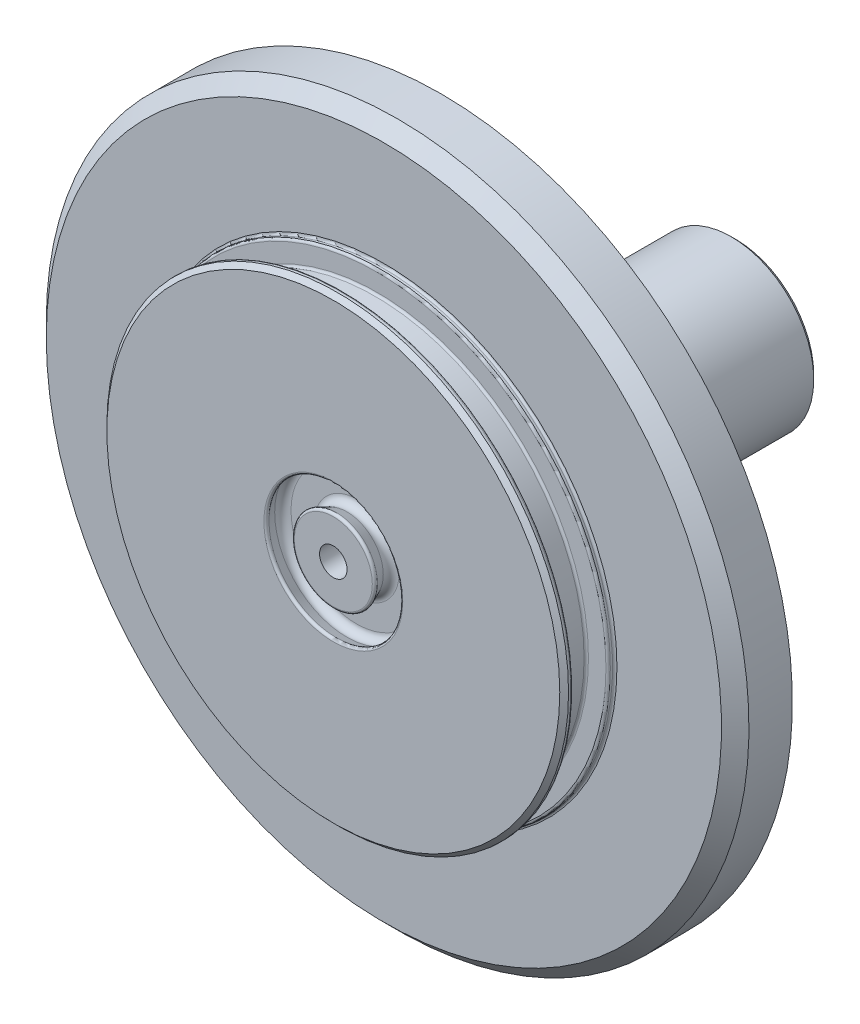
ISO-10303-21;
HEADER;
FILE_DESCRIPTION(('STEP AP214'),'2;1');
FILE_NAME('part.step','',(''),(''),'','','');
FILE_SCHEMA(('AUTOMOTIVE_DESIGN { 1 0 10303 214 1 1 1 1 }'));
ENDSEC;
DATA;
#1=APPLICATION_CONTEXT('core data for automotive mechanical design processes');
#2=APPLICATION_PROTOCOL_DEFINITION('international standard','automotive_design',2000,#1);
#3=PRODUCT_CONTEXT('',#1,'mechanical');
#4=PRODUCT('Part','Part','',(#3));
#5=PRODUCT_RELATED_PRODUCT_CATEGORY('part','',(#4));
#6=PRODUCT_DEFINITION_FORMATION('','',#4);
#7=PRODUCT_DEFINITION_CONTEXT('part definition',#1,'design');
#8=PRODUCT_DEFINITION('design','',#6,#7);
#9=PRODUCT_DEFINITION_SHAPE('','',#8);
#10=(LENGTH_UNIT() NAMED_UNIT(*) SI_UNIT(.MILLI.,.METRE.));
#11=(NAMED_UNIT(*) PLANE_ANGLE_UNIT() SI_UNIT($,.RADIAN.));
#12=(NAMED_UNIT(*) SI_UNIT($,.STERADIAN.) SOLID_ANGLE_UNIT());
#13=UNCERTAINTY_MEASURE_WITH_UNIT(LENGTH_MEASURE(1.E-05),#10,'distance_accuracy_value','');
#14=(GEOMETRIC_REPRESENTATION_CONTEXT(3) GLOBAL_UNCERTAINTY_ASSIGNED_CONTEXT((#13)) GLOBAL_UNIT_ASSIGNED_CONTEXT((#10,
#11,#12)) REPRESENTATION_CONTEXT('',''));
#15=CARTESIAN_POINT('',(0.,0.,0.));
#16=DIRECTION('',(0.,0.,1.));
#17=DIRECTION('',(1.,0.,0.));
#18=AXIS2_PLACEMENT_3D('',#15,#16,#17);
#19=CARTESIAN_POINT('',(0.,0.,1.4605));
#20=DIRECTION('',(0.,0.,-1.));
#21=DIRECTION('',(-1.,0.,0.));
#22=AXIS2_PLACEMENT_3D('',#19,#20,#21);
#23=CYLINDRICAL_SURFACE('',#22,13.335);
#24=CARTESIAN_POINT('',(0.,0.,1.0795));
#25=DIRECTION('',(0.,0.,-1.));
#26=DIRECTION('',(-1.,0.,0.));
#27=AXIS2_PLACEMENT_3D('',#24,#25,#26);
#28=CIRCLE('',#27,13.335);
#29=CARTESIAN_POINT('',(-13.335,0.,1.0795));
#30=VERTEX_POINT('',#29);
#31=EDGE_CURVE('E10',#30,#30,#28,.F.);
#32=ORIENTED_EDGE('',*,*,#31,.T.);
#33=EDGE_LOOP('',(#32));
#34=FACE_BOUND('',#33,.T.);
#35=CARTESIAN_POINT('',(0.,0.,1.20649999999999));
#36=DIRECTION('',(0.,0.,1.));
#37=DIRECTION('',(1.,0.,0.));
#38=AXIS2_PLACEMENT_3D('',#35,#36,#37);
#39=CIRCLE('',#38,13.335);
#40=CARTESIAN_POINT('',(13.335,0.,1.20649999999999));
#41=VERTEX_POINT('',#40);
#42=EDGE_CURVE('E91',#41,#41,#39,.F.);
#43=ORIENTED_EDGE('',*,*,#42,.T.);
#44=EDGE_LOOP('',(#43));
#45=FACE_BOUND('',#44,.T.);
#46=ADVANCED_FACE('F40',(#34,#45),#23,.T.);
#47=CARTESIAN_POINT('',(0.,0.,-1.3335));
#48=DIRECTION('',(0.,0.,-1.));
#49=DIRECTION('',(-1.,0.,0.));
#50=AXIS2_PLACEMENT_3D('',#47,#48,#49);
#51=CIRCLE('',#50,13.335);
#52=CARTESIAN_POINT('',(-13.335,0.,-1.3335));
#53=VERTEX_POINT('',#52);
#54=EDGE_CURVE('E79',#53,#53,#51,.F.);
#55=ORIENTED_EDGE('',*,*,#54,.T.);
#56=EDGE_LOOP('',(#55));
#57=FACE_BOUND('',#56,.T.);
#58=CARTESIAN_POINT('',(0.,0.,-1.2065));
#59=DIRECTION('',(0.,0.,1.));
#60=DIRECTION('',(1.,0.,0.));
#61=AXIS2_PLACEMENT_3D('',#58,#59,#60);
#62=CIRCLE('',#61,13.335);
#63=CARTESIAN_POINT('',(13.335,0.,-1.2065));
#64=VERTEX_POINT('',#63);
#65=EDGE_CURVE('E83',#64,#64,#62,.F.);
#66=ORIENTED_EDGE('',*,*,#65,.T.);
#67=EDGE_LOOP('',(#66));
#68=FACE_BOUND('',#67,.T.);
#69=ADVANCED_FACE('F228',(#57,#68),#23,.T.);
#70=CARTESIAN_POINT('',(0.,0.,-21.7805));
#71=DIRECTION('',(0.,0.,1.));
#72=DIRECTION('',(1.,0.,0.));
#73=AXIS2_PLACEMENT_3D('',#70,#71,#72);
#74=CYLINDRICAL_SURFACE('',#73,4.7625);
#75=CARTESIAN_POINT('',(0.,0.,-2.7305));
#76=DIRECTION('',(0.,0.,-1.));
#77=DIRECTION('',(-1.,0.,0.));
#78=AXIS2_PLACEMENT_3D('',#75,#76,#77);
#79=CIRCLE('',#78,4.7625);
#80=CARTESIAN_POINT('',(4.7625,0.,-2.7305));
#81=VERTEX_POINT('',#80);
#82=EDGE_CURVE('E158',#81,#81,#79,.T.);
#83=CARTESIAN_POINT('',(0.,0.,-9.5885));
#84=DIRECTION('',(0.,0.,-1.));
#85=DIRECTION('',(-1.,0.,0.));
#86=AXIS2_PLACEMENT_3D('',#83,#84,#85);
#87=CIRCLE('',#86,4.7625);
#88=CARTESIAN_POINT('',(4.7625,0.,-9.5885));
#89=VERTEX_POINT('',#88);
#90=EDGE_CURVE('E130',#89,#89,#87,.T.);
#91=CARTESIAN_POINT('',(4.7625,0.,-2.7305));
#92=CARTESIAN_POINT('',(4.7625,0.,-2.8019375));
#93=CARTESIAN_POINT('',(4.7625,0.,-2.873375));
#94=CARTESIAN_POINT('',(4.7625,0.,-3.01625));
#95=CARTESIAN_POINT('',(4.7625,0.,-3.0876875));
#96=CARTESIAN_POINT('',(4.7625,0.,-3.2305625));
#97=CARTESIAN_POINT('',(4.7625,0.,-3.302));
#98=CARTESIAN_POINT('',(4.7625,0.,-3.444875));
#99=CARTESIAN_POINT('',(4.7625,0.,-3.5163125));
#100=CARTESIAN_POINT('',(4.7625,0.,-3.6591875));
#101=CARTESIAN_POINT('',(4.7625,0.,-3.730625));
#102=CARTESIAN_POINT('',(4.7625,0.,-3.8735));
#103=CARTESIAN_POINT('',(4.7625,0.,-3.9449375));
#104=CARTESIAN_POINT('',(4.7625,0.,-4.0878125));
#105=CARTESIAN_POINT('',(4.7625,0.,-4.15925));
#106=CARTESIAN_POINT('',(4.7625,0.,-4.302125));
#107=CARTESIAN_POINT('',(4.7625,0.,-4.3735625));
#108=CARTESIAN_POINT('',(4.7625,0.,-4.5164375));
#109=CARTESIAN_POINT('',(4.7625,0.,-4.587875));
#110=CARTESIAN_POINT('',(4.7625,0.,-4.73075));
#111=CARTESIAN_POINT('',(4.7625,0.,-4.8021875));
#112=CARTESIAN_POINT('',(4.7625,0.,-4.9450625));
#113=CARTESIAN_POINT('',(4.7625,0.,-5.0165));
#114=CARTESIAN_POINT('',(4.7625,0.,-5.159375));
#115=CARTESIAN_POINT('',(4.7625,0.,-5.2308125));
#116=CARTESIAN_POINT('',(4.7625,0.,-5.3736875));
#117=CARTESIAN_POINT('',(4.7625,0.,-5.445125));
#118=CARTESIAN_POINT('',(4.7625,0.,-5.588));
#119=CARTESIAN_POINT('',(4.7625,0.,-5.6594375));
#120=CARTESIAN_POINT('',(4.7625,0.,-5.8023125));
#121=CARTESIAN_POINT('',(4.7625,0.,-5.87375));
#122=CARTESIAN_POINT('',(4.7625,0.,-6.016625));
#123=CARTESIAN_POINT('',(4.7625,0.,-6.0880625));
#124=CARTESIAN_POINT('',(4.7625,0.,-6.2309375));
#125=CARTESIAN_POINT('',(4.7625,0.,-6.302375));
#126=CARTESIAN_POINT('',(4.7625,0.,-6.44525));
#127=CARTESIAN_POINT('',(4.7625,0.,-6.5166875));
#128=CARTESIAN_POINT('',(4.7625,0.,-6.6595625));
#129=CARTESIAN_POINT('',(4.7625,0.,-6.731));
#130=CARTESIAN_POINT('',(4.7625,0.,-6.873875));
#131=CARTESIAN_POINT('',(4.7625,0.,-6.9453125));
#132=CARTESIAN_POINT('',(4.7625,0.,-7.0881875));
#133=CARTESIAN_POINT('',(4.7625,0.,-7.159625));
#134=CARTESIAN_POINT('',(4.7625,0.,-7.3025));
#135=CARTESIAN_POINT('',(4.7625,0.,-7.3739375));
#136=CARTESIAN_POINT('',(4.7625,0.,-7.5168125));
#137=CARTESIAN_POINT('',(4.7625,0.,-7.58825));
#138=CARTESIAN_POINT('',(4.7625,0.,-7.731125));
#139=CARTESIAN_POINT('',(4.7625,0.,-7.8025625));
#140=CARTESIAN_POINT('',(4.7625,0.,-7.9454375));
#141=CARTESIAN_POINT('',(4.7625,0.,-8.016875));
#142=CARTESIAN_POINT('',(4.7625,0.,-8.15975));
#143=CARTESIAN_POINT('',(4.7625,0.,-8.2311875));
#144=CARTESIAN_POINT('',(4.7625,0.,-8.3740625));
#145=CARTESIAN_POINT('',(4.7625,0.,-8.4455));
#146=CARTESIAN_POINT('',(4.7625,0.,-8.588375));
#147=CARTESIAN_POINT('',(4.7625,0.,-8.6598125));
#148=CARTESIAN_POINT('',(4.7625,0.,-8.8026875));
#149=CARTESIAN_POINT('',(4.7625,0.,-8.874125));
#150=CARTESIAN_POINT('',(4.7625,0.,-9.017));
#151=CARTESIAN_POINT('',(4.7625,0.,-9.0884375));
#152=CARTESIAN_POINT('',(4.7625,0.,-9.2313125));
#153=CARTESIAN_POINT('',(4.7625,0.,-9.30275));
#154=CARTESIAN_POINT('',(4.7625,0.,-9.445625));
#155=CARTESIAN_POINT('',(4.7625,0.,-9.5170625));
#156=CARTESIAN_POINT('',(4.7625,0.,-9.5885));
#157=B_SPLINE_CURVE_WITH_KNOTS('',3,(#91,#92,#93,#94,#95,#96,#97,#98,#99,#100,#101,#102,#103,
#104,#105,#106,#107,#108,#109,#110,#111,#112,#113,#114,#115,#116,#117,#118,#119,#120,#121,#122,
#123,#124,#125,#126,#127,#128,#129,#130,#131,#132,#133,#134,#135,#136,#137,#138,#139,#140,#141,
#142,#143,#144,#145,#146,#147,#148,#149,#150,#151,#152,#153,#154,#155,#156),.UNSPECIFIED.,.F.,
.F.,(4,2,2,2,2,2,2,2,2,2,2,2,2,2,2,2,2,2,2,2,2,2,2,2,2,2,2,2,2,2,2,2,4),(0.,0.214312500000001,
0.428625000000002,0.642937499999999,0.85725,1.0715625,1.285875,1.5001875,1.7145,1.9288125,
2.143125,2.3574375,2.57175,2.7860625,3.000375,3.2146875,3.429,3.6433125,3.857625,4.0719375,
4.28625,4.5005625,4.714875,4.9291875,5.1435,5.3578125,5.572125,5.7864375,6.00075,6.2150625,
6.429375,6.6436875,6.858),.UNSPECIFIED.);
#158=EDGE_CURVE('BSEAM218',#81,#89,#157,.T.);
#159=ORIENTED_EDGE('',*,*,#82,.T.);
#160=ORIENTED_EDGE('',*,*,#90,.F.);
#161=ORIENTED_EDGE('',*,*,#158,.T.);
#162=ORIENTED_EDGE('',*,*,#158,.F.);
#163=EDGE_LOOP('',(#159,#161,#160,#162));
#164=FACE_BOUND('',#163,.T.);
#165=ADVANCED_FACE('F218',(#164),#74,.T.);
#166=CARTESIAN_POINT('',(0.,0.,-21.5265));
#167=DIRECTION('',(0.,0.,-1.));
#168=DIRECTION('',(-1.,0.,0.));
#169=AXIS2_PLACEMENT_3D('',#166,#167,#168);
#170=CIRCLE('',#169,4.7625);
#171=CARTESIAN_POINT('',(4.7625,0.,-21.5265));
#172=VERTEX_POINT('',#171);
#173=EDGE_CURVE('E121',#172,#172,#170,.F.);
#174=CARTESIAN_POINT('',(0.,0.,-10.6045));
#175=DIRECTION('',(0.,0.,1.));
#176=DIRECTION('',(1.,0.,0.));
#177=AXIS2_PLACEMENT_3D('',#174,#175,#176);
#178=CIRCLE('',#177,4.7625);
#179=CARTESIAN_POINT('',(4.7625,0.,-10.6045));
#180=VERTEX_POINT('',#179);
#181=EDGE_CURVE('E135',#180,#180,#178,.T.);
#182=CARTESIAN_POINT('',(4.7625,0.,-21.5265));
#183=CARTESIAN_POINT('',(4.7625,0.,-21.4127291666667));
#184=CARTESIAN_POINT('',(4.7625,0.,-21.2989583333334));
#185=CARTESIAN_POINT('',(4.7625,0.,-21.0714166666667));
#186=CARTESIAN_POINT('',(4.7625,0.,-20.9576458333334));
#187=CARTESIAN_POINT('',(4.7625,0.,-20.7301041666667));
#188=CARTESIAN_POINT('',(4.7625,0.,-20.6163333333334));
#189=CARTESIAN_POINT('',(4.7625,0.,-20.3887916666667));
#190=CARTESIAN_POINT('',(4.7625,0.,-20.2750208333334));
#191=CARTESIAN_POINT('',(4.7625,0.,-20.0474791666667));
#192=CARTESIAN_POINT('',(4.7625,0.,-19.9337083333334));
#193=CARTESIAN_POINT('',(4.7625,0.,-19.7061666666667));
#194=CARTESIAN_POINT('',(4.7625,0.,-19.5923958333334));
#195=CARTESIAN_POINT('',(4.7625,0.,-19.3648541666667));
#196=CARTESIAN_POINT('',(4.7625,0.,-19.2510833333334));
#197=CARTESIAN_POINT('',(4.7625,0.,-19.0235416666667));
#198=CARTESIAN_POINT('',(4.7625,0.,-18.9097708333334));
#199=CARTESIAN_POINT('',(4.7625,0.,-18.6822291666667));
#200=CARTESIAN_POINT('',(4.7625,0.,-18.5684583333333));
#201=CARTESIAN_POINT('',(4.7625,0.,-18.3409166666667));
#202=CARTESIAN_POINT('',(4.7625,0.,-18.2271458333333));
#203=CARTESIAN_POINT('',(4.7625,0.,-17.9996041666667));
#204=CARTESIAN_POINT('',(4.7625,0.,-17.8858333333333));
#205=CARTESIAN_POINT('',(4.7625,0.,-17.6582916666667));
#206=CARTESIAN_POINT('',(4.7625,0.,-17.5445208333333));
#207=CARTESIAN_POINT('',(4.7625,0.,-17.3169791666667));
#208=CARTESIAN_POINT('',(4.7625,0.,-17.2032083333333));
#209=CARTESIAN_POINT('',(4.7625,0.,-16.9756666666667));
#210=CARTESIAN_POINT('',(4.7625,0.,-16.8618958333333));
#211=CARTESIAN_POINT('',(4.7625,0.,-16.6343541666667));
#212=CARTESIAN_POINT('',(4.7625,0.,-16.5205833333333));
#213=CARTESIAN_POINT('',(4.7625,0.,-16.2930416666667));
#214=CARTESIAN_POINT('',(4.7625,0.,-16.1792708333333));
#215=CARTESIAN_POINT('',(4.7625,0.,-15.9517291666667));
#216=CARTESIAN_POINT('',(4.7625,0.,-15.8379583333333));
#217=CARTESIAN_POINT('',(4.7625,0.,-15.6104166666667));
#218=CARTESIAN_POINT('',(4.7625,0.,-15.4966458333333));
#219=CARTESIAN_POINT('',(4.7625,0.,-15.2691041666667));
#220=CARTESIAN_POINT('',(4.7625,0.,-15.1553333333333));
#221=CARTESIAN_POINT('',(4.7625,0.,-14.9277916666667));
#222=CARTESIAN_POINT('',(4.7625,0.,-14.8140208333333));
#223=CARTESIAN_POINT('',(4.7625,0.,-14.5864791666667));
#224=CARTESIAN_POINT('',(4.7625,0.,-14.4727083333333));
#225=CARTESIAN_POINT('',(4.7625,0.,-14.2451666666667));
#226=CARTESIAN_POINT('',(4.7625,0.,-14.1313958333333));
#227=CARTESIAN_POINT('',(4.7625,0.,-13.9038541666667));
#228=CARTESIAN_POINT('',(4.7625,0.,-13.7900833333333));
#229=CARTESIAN_POINT('',(4.7625,0.,-13.5625416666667));
#230=CARTESIAN_POINT('',(4.7625,0.,-13.4487708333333));
#231=CARTESIAN_POINT('',(4.7625,0.,-13.2212291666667));
#232=CARTESIAN_POINT('',(4.7625,0.,-13.1074583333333));
#233=CARTESIAN_POINT('',(4.7625,0.,-12.8799166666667));
#234=CARTESIAN_POINT('',(4.7625,0.,-12.7661458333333));
#235=CARTESIAN_POINT('',(4.7625,0.,-12.5386041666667));
#236=CARTESIAN_POINT('',(4.7625,0.,-12.4248333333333));
#237=CARTESIAN_POINT('',(4.7625,0.,-12.1972916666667));
#238=CARTESIAN_POINT('',(4.7625,0.,-12.0835208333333));
#239=CARTESIAN_POINT('',(4.7625,0.,-11.8559791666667));
#240=CARTESIAN_POINT('',(4.7625,0.,-11.7422083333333));
#241=CARTESIAN_POINT('',(4.7625,0.,-11.5146666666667));
#242=CARTESIAN_POINT('',(4.7625,0.,-11.4008958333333));
#243=CARTESIAN_POINT('',(4.7625,0.,-11.1733541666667));
#244=CARTESIAN_POINT('',(4.7625,0.,-11.0595833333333));
#245=CARTESIAN_POINT('',(4.7625,0.,-10.8320416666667));
#246=CARTESIAN_POINT('',(4.7625,0.,-10.7182708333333));
#247=CARTESIAN_POINT('',(4.7625,0.,-10.6045));
#248=B_SPLINE_CURVE_WITH_KNOTS('',3,(#182,#183,#184,#185,#186,#187,#188,#189,#190,#191,#192,
#193,#194,#195,#196,#197,#198,#199,#200,#201,#202,#203,#204,#205,#206,#207,#208,#209,#210,#211,
#212,#213,#214,#215,#216,#217,#218,#219,#220,#221,#222,#223,#224,#225,#226,#227,#228,#229,#230,
#231,#232,#233,#234,#235,#236,#237,#238,#239,#240,#241,#242,#243,#244,#245,#246,#247),
.UNSPECIFIED.,.F.,.F.,(4,2,2,2,2,2,2,2,2,2,2,2,2,2,2,2,2,2,2,2,2,2,2,2,2,2,2,2,2,2,2,2,4),(0.,
0.3413125,0.682624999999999,1.0239375,1.36525,1.7065625,2.047875,2.3891875,2.7305,3.0718125,
3.41312500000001,3.75443750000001,4.09575000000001,4.43706250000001,4.77837500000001,
5.11968750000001,5.46100000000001,5.80231250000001,6.14362500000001,6.48493750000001,
6.82625000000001,7.16756250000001,7.50887500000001,7.85018750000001,8.19150000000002,
8.53281250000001,8.87412500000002,9.21543750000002,9.55675000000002,9.89806250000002,10.239375,
10.5806875,10.922),.UNSPECIFIED.);
#249=EDGE_CURVE('BSEAM215',#172,#180,#248,.T.);
#250=ORIENTED_EDGE('',*,*,#173,.T.);
#251=ORIENTED_EDGE('',*,*,#181,.F.);
#252=ORIENTED_EDGE('',*,*,#249,.T.);
#253=ORIENTED_EDGE('',*,*,#249,.F.);
#254=EDGE_LOOP('',(#250,#252,#251,#253));
#255=FACE_BOUND('',#254,.T.);
#256=ADVANCED_FACE('F215',(#255),#74,.T.);
#257=CARTESIAN_POINT('',(0.,0.,-21.7805));
#258=DIRECTION('',(0.,0.,-1.));
#259=DIRECTION('',(-1.,0.,0.));
#260=AXIS2_PLACEMENT_3D('',#257,#258,#259);
#261=PLANE('',#260);
#262=CARTESIAN_POINT('',(0.,0.,-21.7805));
#263=DIRECTION('',(0.,0.,-1.));
#264=DIRECTION('',(-1.,0.,0.));
#265=AXIS2_PLACEMENT_3D('',#262,#263,#264);
#266=CIRCLE('',#265,4.50850000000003);
#267=CARTESIAN_POINT('',(-4.50850000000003,0.,-21.7805));
#268=VERTEX_POINT('',#267);
#269=EDGE_CURVE('E125',#268,#268,#266,.T.);
#270=ORIENTED_EDGE('',*,*,#269,.T.);
#271=EDGE_LOOP('',(#270));
#272=FACE_BOUND('',#271,.T.);
#273=CARTESIAN_POINT('',(0.,0.,-21.7804999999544));
#274=DIRECTION('',(0.,0.,-1.));
#275=DIRECTION('',(-1.,0.,0.));
#276=AXIS2_PLACEMENT_3D('',#273,#274,#275);
#277=CIRCLE('',#276,3.42899703);
#278=CARTESIAN_POINT('',(-3.42899703,0.,-21.7804999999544));
#279=VERTEX_POINT('',#278);
#280=EDGE_CURVE('E178',#279,#279,#277,.T.);
#281=ORIENTED_EDGE('',*,*,#280,.F.);
#282=EDGE_LOOP('',(#281));
#283=FACE_BOUND('',#282,.T.);
#284=ADVANCED_FACE('F217',(#272,#283),#261,.T.);
#285=CARTESIAN_POINT('',(0.,0.,-2.7305));
#286=DIRECTION('',(0.,0.,-1.));
#287=DIRECTION('',(-1.,0.,0.));
#288=AXIS2_PLACEMENT_3D('',#285,#286,#287);
#289=PLANE('',#288);
#290=CARTESIAN_POINT('',(0.,0.,-2.7305));
#291=DIRECTION('',(0.,0.,-1.));
#292=DIRECTION('',(-1.,0.,0.));
#293=AXIS2_PLACEMENT_3D('',#290,#291,#292);
#294=CIRCLE('',#293,15.3035);
#295=CARTESIAN_POINT('',(-15.3035,0.,-2.7305));
#296=VERTEX_POINT('',#295);
#297=EDGE_CURVE('E129',#296,#296,#294,.F.);
#298=ORIENTED_EDGE('',*,*,#297,.F.);
#299=EDGE_LOOP('',(#298));
#300=FACE_BOUND('',#299,.T.);
#301=ORIENTED_EDGE('',*,*,#82,.F.);
#302=EDGE_LOOP('',(#301));
#303=FACE_BOUND('',#302,.T.);
#304=ADVANCED_FACE('F225',(#300,#303),#289,.T.);
#305=CARTESIAN_POINT('',(0.,0.,1.4605));
#306=DIRECTION('',(0.,0.,1.));
#307=DIRECTION('',(1.,0.,0.));
#308=AXIS2_PLACEMENT_3D('',#305,#306,#307);
#309=PLANE('',#308);
#310=CARTESIAN_POINT('',(0.,0.,1.4605));
#311=DIRECTION('',(0.,0.,1.));
#312=DIRECTION('',(1.,0.,0.));
#313=AXIS2_PLACEMENT_3D('',#310,#311,#312);
#314=CIRCLE('',#313,13.081);
#315=CARTESIAN_POINT('',(13.081,0.,1.4605));
#316=VERTEX_POINT('',#315);
#317=EDGE_CURVE('E94',#316,#316,#314,.T.);
#318=ORIENTED_EDGE('',*,*,#317,.T.);
#319=EDGE_LOOP('',(#318));
#320=FACE_BOUND('',#319,.T.);
#321=CARTESIAN_POINT('',(0.,0.,1.4605));
#322=DIRECTION('',(0.,0.,1.));
#323=DIRECTION('',(1.,0.,0.));
#324=AXIS2_PLACEMENT_3D('',#321,#322,#323);
#325=CIRCLE('',#324,4.01167711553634);
#326=CARTESIAN_POINT('',(4.01167711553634,0.,1.4605));
#327=VERTEX_POINT('',#326);
#328=EDGE_CURVE('E109',#327,#327,#325,.F.);
#329=ORIENTED_EDGE('',*,*,#328,.T.);
#330=EDGE_LOOP('',(#329));
#331=FACE_BOUND('',#330,.T.);
#332=ADVANCED_FACE('F240',(#320,#331),#309,.T.);
#333=CARTESIAN_POINT('',(0.,0.,0.5207));
#334=DIRECTION('',(0.,0.,-1.));
#335=DIRECTION('',(-1.,0.,0.));
#336=AXIS2_PLACEMENT_3D('',#333,#334,#335);
#337=TOROIDAL_SURFACE('',#336,3.78968,0.4064);
#338=CARTESIAN_POINT('',(0.,0.,0.685997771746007));
#339=DIRECTION('',(0.,0.,-1.));
#340=DIRECTION('',(-1.,0.,0.));
#341=AXIS2_PLACEMENT_3D('',#338,#339,#340);
#342=CIRCLE('',#341,4.16094487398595);
#343=CARTESIAN_POINT('',(-4.16094487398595,0.,0.685997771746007));
#344=VERTEX_POINT('',#343);
#345=EDGE_CURVE('E154',#344,#344,#342,.T.);
#346=ORIENTED_EDGE('',*,*,#345,.F.);
#347=EDGE_LOOP('',(#346));
#348=FACE_BOUND('',#347,.T.);
#349=CARTESIAN_POINT('',(0.,0.,0.1143));
#350=DIRECTION('',(0.,0.,-1.));
#351=DIRECTION('',(-1.,0.,0.));
#352=AXIS2_PLACEMENT_3D('',#349,#350,#351);
#353=CIRCLE('',#352,3.78968);
#354=CARTESIAN_POINT('',(-3.78968,0.,0.1143));
#355=VERTEX_POINT('',#354);
#356=EDGE_CURVE('E142',#355,#355,#353,.T.);
#357=ORIENTED_EDGE('',*,*,#356,.T.);
#358=EDGE_LOOP('',(#357));
#359=FACE_BOUND('',#358,.T.);
#360=ADVANCED_FACE('F368',(#348,#359),#337,.F.);
#361=CARTESIAN_POINT('',(0.,2.45872,0.1143));
#362=DIRECTION('',(0.,0.,-1.));
#363=DIRECTION('',(-1.,0.,0.));
#364=AXIS2_PLACEMENT_3D('',#361,#362,#363);
#365=PLANE('',#364);
#366=ORIENTED_EDGE('',*,*,#356,.F.);
#367=EDGE_LOOP('',(#366));
#368=FACE_BOUND('',#367,.T.);
#369=CARTESIAN_POINT('',(0.,0.,0.1143));
#370=DIRECTION('',(0.,0.,-1.));
#371=DIRECTION('',(-1.,0.,0.));
#372=AXIS2_PLACEMENT_3D('',#369,#370,#371);
#373=CIRCLE('',#372,2.45872);
#374=CARTESIAN_POINT('',(-2.45872,0.,0.1143));
#375=VERTEX_POINT('',#374);
#376=EDGE_CURVE('E146',#375,#375,#373,.T.);
#377=ORIENTED_EDGE('',*,*,#376,.T.);
#378=EDGE_LOOP('',(#377));
#379=FACE_BOUND('',#378,.T.);
#380=ADVANCED_FACE('F365',(#368,#379),#365,.F.);
#381=CARTESIAN_POINT('',(0.,0.,0.51054));
#382=DIRECTION('',(0.,0.,-1.));
#383=DIRECTION('',(-1.,0.,0.));
#384=AXIS2_PLACEMENT_3D('',#381,#382,#383);
#385=TOROIDAL_SURFACE('',#384,2.45872,0.39624);
#386=ORIENTED_EDGE('',*,*,#376,.F.);
#387=EDGE_LOOP('',(#386));
#388=FACE_BOUND('',#387,.T.);
#389=CARTESIAN_POINT('',(0.,0.,0.671705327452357));
#390=DIRECTION('',(0.,0.,-1.));
#391=DIRECTION('',(-1.,0.,0.));
#392=AXIS2_PLACEMENT_3D('',#389,#390,#391);
#393=CIRCLE('',#392,2.0967367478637);
#394=CARTESIAN_POINT('',(-2.0967367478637,0.,0.671705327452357));
#395=VERTEX_POINT('',#394);
#396=EDGE_CURVE('E150',#395,#395,#393,.T.);
#397=ORIENTED_EDGE('',*,*,#396,.T.);
#398=EDGE_LOOP('',(#397));
#399=FACE_BOUND('',#398,.T.);
#400=ADVANCED_FACE('F361',(#388,#399),#385,.F.);
#401=CARTESIAN_POINT('',(0.,0.,1.4605));
#402=DIRECTION('',(0.,0.,1.));
#403=DIRECTION('',(1.,0.,0.));
#404=AXIS2_PLACEMENT_3D('',#401,#402,#403);
#405=CONICAL_SURFACE('',#404,2.44793076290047,0.418879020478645);
#406=CARTESIAN_POINT('',(0.,0.,1.28184444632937));
#407=DIRECTION('',(0.,0.,1.));
#408=DIRECTION('',(1.,0.,0.));
#409=AXIS2_PLACEMENT_3D('',#406,#407,#408);
#410=CIRCLE('',#409,2.36838818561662);
#411=CARTESIAN_POINT('',(2.36838818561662,0.,1.28184444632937));
#412=VERTEX_POINT('',#411);
#413=EDGE_CURVE('E101',#412,#412,#410,.F.);
#414=ORIENTED_EDGE('',*,*,#413,.T.);
#415=EDGE_LOOP('',(#414));
#416=FACE_BOUND('',#415,.T.);
#417=ORIENTED_EDGE('',*,*,#396,.F.);
#418=EDGE_LOOP('',(#417));
#419=FACE_BOUND('',#418,.T.);
#420=ADVANCED_FACE('F357',(#416,#419),#405,.T.);
#421=CARTESIAN_POINT('',(0.,0.,0.685997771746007));
#422=DIRECTION('',(0.,0.,-1.));
#423=DIRECTION('',(-1.,0.,0.));
#424=AXIS2_PLACEMENT_3D('',#421,#422,#423);
#425=CONICAL_SURFACE('',#424,4.16094487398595,0.418879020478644);
#426=CARTESIAN_POINT('',(0.,0.,1.28184444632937));
#427=DIRECTION('',(0.,0.,-1.));
#428=DIRECTION('',(-1.,0.,0.));
#429=AXIS2_PLACEMENT_3D('',#426,#427,#428);
#430=CIRCLE('',#429,3.89565684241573);
#431=CARTESIAN_POINT('',(-3.89565684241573,0.,1.28184444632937));
#432=VERTEX_POINT('',#431);
#433=EDGE_CURVE('E105',#432,#432,#430,.F.);
#434=ORIENTED_EDGE('',*,*,#433,.T.);
#435=EDGE_LOOP('',(#434));
#436=FACE_BOUND('',#435,.T.);
#437=ORIENTED_EDGE('',*,*,#345,.T.);
#438=EDGE_LOOP('',(#437));
#439=FACE_BOUND('',#438,.T.);
#440=ADVANCED_FACE('F354',(#436,#439),#425,.F.);
#441=CARTESIAN_POINT('',(0.,0.,1.4605));
#442=DIRECTION('',(0.,0.,1.));
#443=DIRECTION('',(1.,0.,0.));
#444=AXIS2_PLACEMENT_3D('',#441,#442,#443);
#445=CIRCLE('',#444,2.25236791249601);
#446=CARTESIAN_POINT('',(2.25236791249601,0.,1.4605));
#447=VERTEX_POINT('',#446);
#448=EDGE_CURVE('E97',#447,#447,#445,.T.);
#449=ORIENTED_EDGE('',*,*,#448,.T.);
#450=EDGE_LOOP('',(#449));
#451=FACE_BOUND('',#450,.T.);
#452=CARTESIAN_POINT('',(0.,0.,1.4605));
#453=DIRECTION('',(0.,0.,-1.));
#454=DIRECTION('',(0.,1.,0.));
#455=AXIS2_PLACEMENT_3D('',#452,#453,#454);
#456=CIRCLE('',#455,0.793749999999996);
#457=CARTESIAN_POINT('',(0.,0.793749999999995,1.4605));
#458=VERTEX_POINT('',#457);
#459=EDGE_CURVE('E186',#458,#458,#456,.T.);
#460=ORIENTED_EDGE('',*,*,#459,.T.);
#461=EDGE_LOOP('',(#460));
#462=FACE_BOUND('',#461,.T.);
#463=ADVANCED_FACE('F349',(#451,#462),#309,.T.);
#464=CARTESIAN_POINT('',(0.,0.,-1.4605));
#465=DIRECTION('',(0.,0.,-1.));
#466=DIRECTION('',(-1.,0.,0.));
#467=AXIS2_PLACEMENT_3D('',#464,#465,#466);
#468=PLANE('',#467);
#469=CARTESIAN_POINT('',(0.,0.,-1.4605));
#470=DIRECTION('',(0.,0.,-1.));
#471=DIRECTION('',(-1.,0.,0.));
#472=AXIS2_PLACEMENT_3D('',#469,#470,#471);
#473=CIRCLE('',#472,13.462);
#474=CARTESIAN_POINT('',(-13.462,0.,-1.4605));
#475=VERTEX_POINT('',#474);
#476=EDGE_CURVE('E87',#475,#475,#473,.T.);
#477=ORIENTED_EDGE('',*,*,#476,.T.);
#478=EDGE_LOOP('',(#477));
#479=FACE_BOUND('',#478,.T.);
#480=CARTESIAN_POINT('',(0.,0.,-1.4605));
#481=DIRECTION('',(0.,0.,-1.));
#482=DIRECTION('',(-1.,0.,0.));
#483=AXIS2_PLACEMENT_3D('',#480,#481,#482);
#484=CIRCLE('',#483,19.50085);
#485=CARTESIAN_POINT('',(-19.50085,0.,-1.4605));
#486=VERTEX_POINT('',#485);
#487=EDGE_CURVE('E113',#486,#486,#484,.F.);
#488=ORIENTED_EDGE('',*,*,#487,.T.);
#489=EDGE_LOOP('',(#488));
#490=FACE_BOUND('',#489,.T.);
#491=ADVANCED_FACE('F338',(#479,#490),#468,.F.);
#492=CARTESIAN_POINT('',(0.,0.,-2.7305));
#493=DIRECTION('',(0.,0.,1.));
#494=DIRECTION('',(1.,0.,0.));
#495=AXIS2_PLACEMENT_3D('',#492,#493,#494);
#496=CYLINDRICAL_SURFACE('',#495,20.2946);
#497=CARTESIAN_POINT('',(0.,0.,-2.25425000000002));
#498=DIRECTION('',(0.,0.,-1.));
#499=DIRECTION('',(-1.,0.,0.));
#500=AXIS2_PLACEMENT_3D('',#497,#498,#499);
#501=CIRCLE('',#500,20.2946);
#502=CARTESIAN_POINT('',(-20.2946,0.,-2.25425000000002));
#503=VERTEX_POINT('',#502);
#504=EDGE_CURVE('E117',#503,#503,#501,.T.);
#505=ORIENTED_EDGE('',*,*,#504,.T.);
#506=EDGE_LOOP('',(#505));
#507=FACE_BOUND('',#506,.T.);
#508=CARTESIAN_POINT('',(0.,0.,-4.7625));
#509=DIRECTION('',(0.,0.,-1.));
#510=DIRECTION('',(0.,1.,0.));
#511=AXIS2_PLACEMENT_3D('',#508,#509,#510);
#512=CIRCLE('',#511,20.2946);
#513=CARTESIAN_POINT('',(0.,20.2946,-4.7625));
#514=VERTEX_POINT('',#513);
#515=EDGE_CURVE('E190',#514,#514,#512,.T.);
#516=ORIENTED_EDGE('',*,*,#515,.F.);
#517=EDGE_LOOP('',(#516));
#518=FACE_BOUND('',#517,.T.);
#519=ADVANCED_FACE('F333',(#507,#518),#496,.T.);
#520=CARTESIAN_POINT('',(0.,0.,-13.8430068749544));
#521=DIRECTION('',(0.,0.,-1.));
#522=DIRECTION('',(-1.,0.,0.));
#523=AXIS2_PLACEMENT_3D('',#520,#521,#522);
#524=PLANE('',#523);
#525=CARTESIAN_POINT('',(0.,0.,-13.8430068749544));
#526=DIRECTION('',(0.,0.,-1.));
#527=DIRECTION('',(0.,1.,0.));
#528=AXIS2_PLACEMENT_3D('',#525,#526,#527);
#529=CIRCLE('',#528,0.793749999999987);
#530=CARTESIAN_POINT('',(0.,0.793749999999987,-13.8430068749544));
#531=VERTEX_POINT('',#530);
#532=EDGE_CURVE('E182',#531,#531,#529,.T.);
#533=ORIENTED_EDGE('',*,*,#532,.F.);
#534=EDGE_LOOP('',(#533));
#535=FACE_BOUND('',#534,.T.);
#536=CARTESIAN_POINT('',(0.,0.,-13.8430068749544));
#537=DIRECTION('',(0.,0.,-1.));
#538=DIRECTION('',(-1.,0.,0.));
#539=AXIS2_PLACEMENT_3D('',#536,#537,#538);
#540=CIRCLE('',#539,2.70509765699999);
#541=CARTESIAN_POINT('',(-2.70509765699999,0.,-13.8430068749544));
#542=VERTEX_POINT('',#541);
#543=EDGE_CURVE('E162',#542,#542,#540,.T.);
#544=ORIENTED_EDGE('',*,*,#543,.T.);
#545=EDGE_LOOP('',(#544));
#546=FACE_BOUND('',#545,.T.);
#547=ADVANCED_FACE('F330',(#535,#546),#524,.T.);
#548=CARTESIAN_POINT('',(0.,0.,-21.7804999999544));
#549=DIRECTION('',(0.,0.,-1.));
#550=DIRECTION('',(-1.,0.,0.));
#551=AXIS2_PLACEMENT_3D('',#548,#549,#550);
#552=CYLINDRICAL_SURFACE('',#551,2.705097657);
#553=CARTESIAN_POINT('',(0.,0.,-14.7497860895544));
#554=DIRECTION('',(0.,0.,-1.));
#555=DIRECTION('',(-1.,0.,0.));
#556=AXIS2_PLACEMENT_3D('',#553,#554,#555);
#557=CIRCLE('',#556,2.705097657);
#558=CARTESIAN_POINT('',(-2.705097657,0.,-14.7497860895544));
#559=VERTEX_POINT('',#558);
#560=EDGE_CURVE('E166',#559,#559,#557,.T.);
#561=ORIENTED_EDGE('',*,*,#560,.T.);
#562=EDGE_LOOP('',(#561));
#563=FACE_BOUND('',#562,.T.);
#564=ORIENTED_EDGE('',*,*,#543,.F.);
#565=EDGE_LOOP('',(#564));
#566=FACE_BOUND('',#565,.T.);
#567=ADVANCED_FACE('F326',(#563,#566),#552,.F.);
#568=CARTESIAN_POINT('',(2.705097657,0.,-14.7497860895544));
#569=DIRECTION('',(0.,0.,-1.));
#570=DIRECTION('',(-1.,0.,0.));
#571=AXIS2_PLACEMENT_3D('',#568,#569,#570);
#572=PLANE('',#571);
#573=CARTESIAN_POINT('',(0.,0.,-14.7497860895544));
#574=DIRECTION('',(0.,0.,-1.));
#575=DIRECTION('',(-1.,0.,0.));
#576=AXIS2_PLACEMENT_3D('',#573,#574,#575);
#577=CIRCLE('',#576,3.17499725);
#578=CARTESIAN_POINT('',(-3.17499725,0.,-14.7497860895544));
#579=VERTEX_POINT('',#578);
#580=EDGE_CURVE('E170',#579,#579,#577,.T.);
#581=ORIENTED_EDGE('',*,*,#580,.T.);
#582=EDGE_LOOP('',(#581));
#583=FACE_BOUND('',#582,.T.);
#584=ORIENTED_EDGE('',*,*,#560,.F.);
#585=EDGE_LOOP('',(#584));
#586=FACE_BOUND('',#585,.T.);
#587=ADVANCED_FACE('F322',(#583,#586),#572,.T.);
#588=CARTESIAN_POINT('',(0.,0.,-21.7804999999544));
#589=DIRECTION('',(0.,0.,-1.));
#590=DIRECTION('',(-1.,0.,0.));
#591=AXIS2_PLACEMENT_3D('',#588,#589,#590);
#592=CYLINDRICAL_SURFACE('',#591,3.17499725);
#593=CARTESIAN_POINT('',(0.,0.,-21.1672905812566));
#594=DIRECTION('',(0.,0.,-1.));
#595=DIRECTION('',(-1.,0.,0.));
#596=AXIS2_PLACEMENT_3D('',#593,#594,#595);
#597=CIRCLE('',#596,3.17499725);
#598=CARTESIAN_POINT('',(-3.17499725,0.,-21.1672905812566));
#599=VERTEX_POINT('',#598);
#600=EDGE_CURVE('E174',#599,#599,#597,.T.);
#601=ORIENTED_EDGE('',*,*,#600,.T.);
#602=EDGE_LOOP('',(#601));
#603=FACE_BOUND('',#602,.T.);
#604=ORIENTED_EDGE('',*,*,#580,.F.);
#605=EDGE_LOOP('',(#604));
#606=FACE_BOUND('',#605,.T.);
#607=ADVANCED_FACE('F318',(#603,#606),#592,.F.);
#608=CARTESIAN_POINT('',(0.,0.,-21.1672905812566));
#609=DIRECTION('',(0.,0.,-1.));
#610=DIRECTION('',(-1.,0.,0.));
#611=AXIS2_PLACEMENT_3D('',#608,#609,#610);
#612=CONICAL_SURFACE('',#611,3.17499725,0.392699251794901);
#613=ORIENTED_EDGE('',*,*,#280,.T.);
#614=EDGE_LOOP('',(#613));
#615=FACE_BOUND('',#614,.T.);
#616=ORIENTED_EDGE('',*,*,#600,.F.);
#617=EDGE_LOOP('',(#616));
#618=FACE_BOUND('',#617,.T.);
#619=ADVANCED_FACE('F314',(#615,#618),#612,.F.);
#620=CARTESIAN_POINT('',(0.,0.,-13.8430068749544));
#621=DIRECTION('',(0.,0.,-1.));
#622=DIRECTION('',(0.,1.,0.));
#623=AXIS2_PLACEMENT_3D('',#620,#621,#622);
#624=CYLINDRICAL_SURFACE('',#623,0.793749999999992);
#625=ORIENTED_EDGE('',*,*,#459,.F.);
#626=EDGE_LOOP('',(#625));
#627=FACE_BOUND('',#626,.T.);
#628=ORIENTED_EDGE('',*,*,#532,.T.);
#629=EDGE_LOOP('',(#628));
#630=FACE_BOUND('',#629,.T.);
#631=ADVANCED_FACE('F310',(#627,#630),#624,.F.);
#632=CARTESIAN_POINT('',(0.,0.,-4.7625));
#633=DIRECTION('',(0.,0.,-1.));
#634=DIRECTION('',(0.,1.,0.));
#635=AXIS2_PLACEMENT_3D('',#632,#633,#634);
#636=PLANE('',#635);
#637=ORIENTED_EDGE('',*,*,#515,.T.);
#638=EDGE_LOOP('',(#637));
#639=FACE_BOUND('',#638,.T.);
#640=CARTESIAN_POINT('',(0.,0.,-4.7625));
#641=DIRECTION('',(0.,0.,-1.));
#642=DIRECTION('',(0.,1.,0.));
#643=AXIS2_PLACEMENT_3D('',#640,#641,#642);
#644=CIRCLE('',#643,15.3035);
#645=CARTESIAN_POINT('',(0.,15.3035,-4.7625));
#646=VERTEX_POINT('',#645);
#647=EDGE_CURVE('E134',#646,#646,#644,.T.);
#648=ORIENTED_EDGE('',*,*,#647,.F.);
#649=EDGE_LOOP('',(#648));
#650=FACE_BOUND('',#649,.T.);
#651=ADVANCED_FACE('F306',(#639,#650),#636,.T.);
#652=CARTESIAN_POINT('',(0.,0.,-4.7625));
#653=DIRECTION('',(0.,0.,1.));
#654=DIRECTION('',(0.,-1.,0.));
#655=AXIS2_PLACEMENT_3D('',#652,#653,#654);
#656=CYLINDRICAL_SURFACE('',#655,15.3035);
#657=ORIENTED_EDGE('',*,*,#647,.T.);
#658=EDGE_LOOP('',(#657));
#659=FACE_BOUND('',#658,.T.);
#660=ORIENTED_EDGE('',*,*,#297,.T.);
#661=EDGE_LOOP('',(#660));
#662=FACE_BOUND('',#661,.T.);
#663=ADVANCED_FACE('F302',(#659,#662),#656,.F.);
#664=CARTESIAN_POINT('',(0.,5.6515,-9.5885));
#665=DIRECTION('',(0.,0.,-1.));
#666=DIRECTION('',(-1.,0.,0.));
#667=AXIS2_PLACEMENT_3D('',#664,#665,#666);
#668=PLANE('',#667);
#669=CARTESIAN_POINT('',(0.,0.,-9.5885));
#670=DIRECTION('',(0.,0.,1.));
#671=DIRECTION('',(1.,0.,0.));
#672=AXIS2_PLACEMENT_3D('',#669,#670,#671);
#673=CIRCLE('',#672,4.1275);
#674=CARTESIAN_POINT('',(4.1275,0.,-9.5885));
#675=VERTEX_POINT('',#674);
#676=EDGE_CURVE('E139',#675,#675,#673,.T.);
#677=ORIENTED_EDGE('',*,*,#676,.T.);
#678=EDGE_LOOP('',(#677));
#679=FACE_BOUND('',#678,.T.);
#680=ORIENTED_EDGE('',*,*,#90,.T.);
#681=EDGE_LOOP('',(#680));
#682=FACE_BOUND('',#681,.T.);
#683=ADVANCED_FACE('F211',(#679,#682),#668,.T.);
#684=CARTESIAN_POINT('',(0.,5.6515,-10.6045));
#685=DIRECTION('',(0.,0.,1.));
#686=DIRECTION('',(1.,0.,0.));
#687=AXIS2_PLACEMENT_3D('',#684,#685,#686);
#688=PLANE('',#687);
#689=CARTESIAN_POINT('',(0.,0.,-10.6045));
#690=DIRECTION('',(0.,0.,1.));
#691=DIRECTION('',(1.,0.,0.));
#692=AXIS2_PLACEMENT_3D('',#689,#690,#691);
#693=CIRCLE('',#692,4.1275);
#694=CARTESIAN_POINT('',(4.1275,0.,-10.6045));
#695=VERTEX_POINT('',#694);
#696=EDGE_CURVE('E200',#695,#695,#693,.T.);
#697=ORIENTED_EDGE('',*,*,#696,.F.);
#698=EDGE_LOOP('',(#697));
#699=FACE_BOUND('',#698,.T.);
#700=ORIENTED_EDGE('',*,*,#181,.T.);
#701=EDGE_LOOP('',(#700));
#702=FACE_BOUND('',#701,.T.);
#703=ADVANCED_FACE('F208',(#699,#702),#688,.T.);
#704=CARTESIAN_POINT('',(0.,0.,0.));
#705=DIRECTION('',(0.,0.,1.));
#706=DIRECTION('',(1.,0.,0.));
#707=AXIS2_PLACEMENT_3D('',#704,#705,#706);
#708=CYLINDRICAL_SURFACE('',#707,4.1275);
#709=ORIENTED_EDGE('',*,*,#696,.T.);
#710=EDGE_LOOP('',(#709));
#711=FACE_BOUND('',#710,.T.);
#712=ORIENTED_EDGE('',*,*,#676,.F.);
#713=EDGE_LOOP('',(#712));
#714=FACE_BOUND('',#713,.T.);
#715=ADVANCED_FACE('F205',(#711,#714),#708,.T.);
#716=CARTESIAN_POINT('',(0.,0.,-21.7805));
#717=DIRECTION('',(0.,0.,1.));
#718=DIRECTION('',(1.,0.,0.));
#719=AXIS2_PLACEMENT_3D('',#716,#717,#718);
#720=CONICAL_SURFACE('',#719,4.50850000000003,0.785398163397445);
#721=ORIENTED_EDGE('',*,*,#173,.F.);
#722=EDGE_LOOP('',(#721));
#723=FACE_BOUND('',#722,.T.);
#724=ORIENTED_EDGE('',*,*,#269,.F.);
#725=EDGE_LOOP('',(#724));
#726=FACE_BOUND('',#725,.T.);
#727=ADVANCED_FACE('F242',(#723,#726),#720,.T.);
#728=CARTESIAN_POINT('',(0.,0.,-2.25425000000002));
#729=DIRECTION('',(0.,0.,-1.));
#730=DIRECTION('',(-1.,0.,0.));
#731=AXIS2_PLACEMENT_3D('',#728,#729,#730);
#732=CONICAL_SURFACE('',#731,20.2946,0.785398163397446);
#733=ORIENTED_EDGE('',*,*,#487,.F.);
#734=EDGE_LOOP('',(#733));
#735=FACE_BOUND('',#734,.T.);
#736=ORIENTED_EDGE('',*,*,#504,.F.);
#737=EDGE_LOOP('',(#736));
#738=FACE_BOUND('',#737,.T.);
#739=ADVANCED_FACE('F245',(#735,#738),#732,.T.);
#740=CARTESIAN_POINT('',(0.,0.,1.3335));
#741=DIRECTION('',(0.,0.,1.));
#742=DIRECTION('',(1.,0.,0.));
#743=AXIS2_PLACEMENT_3D('',#740,#741,#742);
#744=TOROIDAL_SURFACE('',#743,4.01167711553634,0.127);
#745=ORIENTED_EDGE('',*,*,#433,.F.);
#746=EDGE_LOOP('',(#745));
#747=FACE_BOUND('',#746,.T.);
#748=ORIENTED_EDGE('',*,*,#328,.F.);
#749=EDGE_LOOP('',(#748));
#750=FACE_BOUND('',#749,.T.);
#751=ADVANCED_FACE('F249',(#747,#750),#744,.T.);
#752=CARTESIAN_POINT('',(0.,0.,1.3335));
#753=DIRECTION('',(0.,0.,1.));
#754=DIRECTION('',(1.,0.,0.));
#755=AXIS2_PLACEMENT_3D('',#752,#753,#754);
#756=TOROIDAL_SURFACE('',#755,2.25236791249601,0.127);
#757=ORIENTED_EDGE('',*,*,#448,.F.);
#758=EDGE_LOOP('',(#757));
#759=FACE_BOUND('',#758,.T.);
#760=ORIENTED_EDGE('',*,*,#413,.F.);
#761=EDGE_LOOP('',(#760));
#762=FACE_BOUND('',#761,.T.);
#763=ADVANCED_FACE('F253',(#759,#762),#756,.T.);
#764=CARTESIAN_POINT('',(0.,13.335,0.9525));
#765=DIRECTION('',(0.,0.,-1.));
#766=DIRECTION('',(-1.,0.,0.));
#767=AXIS2_PLACEMENT_3D('',#764,#765,#766);
#768=PLANE('',#767);
#769=CARTESIAN_POINT('',(0.,0.,0.9525));
#770=DIRECTION('',(0.,0.,-1.));
#771=DIRECTION('',(-1.,0.,0.));
#772=AXIS2_PLACEMENT_3D('',#769,#770,#771);
#773=CIRCLE('',#772,12.19835);
#774=CARTESIAN_POINT('',(-12.19835,0.,0.9525));
#775=VERTEX_POINT('',#774);
#776=EDGE_CURVE('E48',#775,#775,#773,.F.);
#777=ORIENTED_EDGE('',*,*,#776,.T.);
#778=EDGE_LOOP('',(#777));
#779=FACE_BOUND('',#778,.T.);
#780=CARTESIAN_POINT('',(0.,0.,0.9525));
#781=DIRECTION('',(0.,0.,-1.));
#782=DIRECTION('',(-1.,0.,0.));
#783=AXIS2_PLACEMENT_3D('',#780,#781,#782);
#784=CIRCLE('',#783,13.208);
#785=CARTESIAN_POINT('',(-13.208,0.,0.9525));
#786=VERTEX_POINT('',#785);
#787=EDGE_CURVE('E55',#786,#786,#784,.T.);
#788=ORIENTED_EDGE('',*,*,#787,.T.);
#789=EDGE_LOOP('',(#788));
#790=FACE_BOUND('',#789,.T.);
#791=ADVANCED_FACE('F257',(#779,#790),#768,.T.);
#792=CARTESIAN_POINT('',(0.,0.,0.));
#793=DIRECTION('',(0.,0.,1.));
#794=DIRECTION('',(1.,0.,0.));
#795=AXIS2_PLACEMENT_3D('',#792,#793,#794);
#796=CYLINDRICAL_SURFACE('',#795,12.07135);
#797=CARTESIAN_POINT('',(0.,0.,-0.9525));
#798=DIRECTION('',(0.,0.,1.));
#799=DIRECTION('',(1.,0.,0.));
#800=AXIS2_PLACEMENT_3D('',#797,#798,#799);
#801=CIRCLE('',#800,12.07135);
#802=CARTESIAN_POINT('',(12.07135,0.,-0.9525));
#803=VERTEX_POINT('',#802);
#804=EDGE_CURVE('E72',#803,#803,#801,.T.);
#805=ORIENTED_EDGE('',*,*,#804,.T.);
#806=EDGE_LOOP('',(#805));
#807=FACE_BOUND('',#806,.T.);
#808=CARTESIAN_POINT('',(0.,0.,0.8255));
#809=DIRECTION('',(0.,0.,-1.));
#810=DIRECTION('',(-1.,0.,0.));
#811=AXIS2_PLACEMENT_3D('',#808,#809,#810);
#812=CIRCLE('',#811,12.07135);
#813=CARTESIAN_POINT('',(-12.07135,0.,0.8255));
#814=VERTEX_POINT('',#813);
#815=EDGE_CURVE('E76',#814,#814,#812,.T.);
#816=ORIENTED_EDGE('',*,*,#815,.T.);
#817=EDGE_LOOP('',(#816));
#818=FACE_BOUND('',#817,.T.);
#819=ADVANCED_FACE('F287',(#807,#818),#796,.T.);
#820=CARTESIAN_POINT('',(0.,13.335,-1.0795));
#821=DIRECTION('',(0.,0.,1.));
#822=DIRECTION('',(1.,0.,0.));
#823=AXIS2_PLACEMENT_3D('',#820,#821,#822);
#824=PLANE('',#823);
#825=CARTESIAN_POINT('',(0.,0.,-1.0795));
#826=DIRECTION('',(0.,0.,1.));
#827=DIRECTION('',(1.,0.,0.));
#828=AXIS2_PLACEMENT_3D('',#825,#826,#827);
#829=CIRCLE('',#828,12.19835);
#830=CARTESIAN_POINT('',(12.19835,0.,-1.0795));
#831=VERTEX_POINT('',#830);
#832=EDGE_CURVE('E62',#831,#831,#829,.F.);
#833=ORIENTED_EDGE('',*,*,#832,.T.);
#834=EDGE_LOOP('',(#833));
#835=FACE_BOUND('',#834,.T.);
#836=CARTESIAN_POINT('',(0.,0.,-1.0795));
#837=DIRECTION('',(0.,0.,1.));
#838=DIRECTION('',(1.,0.,0.));
#839=AXIS2_PLACEMENT_3D('',#836,#837,#838);
#840=CIRCLE('',#839,13.208);
#841=CARTESIAN_POINT('',(13.208,0.,-1.0795));
#842=VERTEX_POINT('',#841);
#843=EDGE_CURVE('E68',#842,#842,#840,.T.);
#844=ORIENTED_EDGE('',*,*,#843,.T.);
#845=EDGE_LOOP('',(#844));
#846=FACE_BOUND('',#845,.T.);
#847=ADVANCED_FACE('F263',(#835,#846),#824,.T.);
#848=CARTESIAN_POINT('',(0.,0.,1.4605));
#849=DIRECTION('',(0.,0.,-1.));
#850=DIRECTION('',(-1.,0.,0.));
#851=AXIS2_PLACEMENT_3D('',#848,#849,#850);
#852=CONICAL_SURFACE('',#851,13.081,0.785398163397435);
#853=ORIENTED_EDGE('',*,*,#42,.F.);
#854=EDGE_LOOP('',(#853));
#855=FACE_BOUND('',#854,.T.);
#856=ORIENTED_EDGE('',*,*,#317,.F.);
#857=EDGE_LOOP('',(#856));
#858=FACE_BOUND('',#857,.T.);
#859=ADVANCED_FACE('F259',(#855,#858),#852,.T.);
#860=CARTESIAN_POINT('',(0.,0.,-1.3335));
#861=DIRECTION('',(0.,0.,-1.));
#862=DIRECTION('',(-1.,0.,0.));
#863=AXIS2_PLACEMENT_3D('',#860,#861,#862);
#864=TOROIDAL_SURFACE('',#863,13.462,0.127);
#865=ORIENTED_EDGE('',*,*,#54,.F.);
#866=EDGE_LOOP('',(#865));
#867=FACE_BOUND('',#866,.T.);
#868=ORIENTED_EDGE('',*,*,#476,.F.);
#869=EDGE_LOOP('',(#868));
#870=FACE_BOUND('',#869,.T.);
#871=ADVANCED_FACE('F262',(#867,#870),#864,.F.);
#872=CARTESIAN_POINT('',(0.,0.,-0.9525));
#873=DIRECTION('',(0.,0.,1.));
#874=DIRECTION('',(1.,0.,0.));
#875=AXIS2_PLACEMENT_3D('',#872,#873,#874);
#876=TOROIDAL_SURFACE('',#875,12.19835,0.127);
#877=ORIENTED_EDGE('',*,*,#832,.F.);
#878=EDGE_LOOP('',(#877));
#879=FACE_BOUND('',#878,.T.);
#880=ORIENTED_EDGE('',*,*,#804,.F.);
#881=EDGE_LOOP('',(#880));
#882=FACE_BOUND('',#881,.T.);
#883=ADVANCED_FACE('F267',(#879,#882),#876,.F.);
#884=CARTESIAN_POINT('',(0.,0.,0.8255));
#885=DIRECTION('',(0.,0.,-1.));
#886=DIRECTION('',(-1.,0.,0.));
#887=AXIS2_PLACEMENT_3D('',#884,#885,#886);
#888=TOROIDAL_SURFACE('',#887,12.19835,0.127);
#889=ORIENTED_EDGE('',*,*,#815,.F.);
#890=EDGE_LOOP('',(#889));
#891=FACE_BOUND('',#890,.T.);
#892=ORIENTED_EDGE('',*,*,#776,.F.);
#893=EDGE_LOOP('',(#892));
#894=FACE_BOUND('',#893,.T.);
#895=ADVANCED_FACE('F271',(#891,#894),#888,.F.);
#896=CARTESIAN_POINT('',(0.,0.,-1.2065));
#897=DIRECTION('',(0.,0.,1.));
#898=DIRECTION('',(1.,0.,0.));
#899=AXIS2_PLACEMENT_3D('',#896,#897,#898);
#900=TOROIDAL_SURFACE('',#899,13.208,0.127);
#901=ORIENTED_EDGE('',*,*,#65,.F.);
#902=EDGE_LOOP('',(#901));
#903=FACE_BOUND('',#902,.T.);
#904=ORIENTED_EDGE('',*,*,#843,.F.);
#905=EDGE_LOOP('',(#904));
#906=FACE_BOUND('',#905,.T.);
#907=ADVANCED_FACE('F274',(#903,#906),#900,.T.);
#908=CARTESIAN_POINT('',(0.,0.,1.0795));
#909=DIRECTION('',(0.,0.,-1.));
#910=DIRECTION('',(-1.,0.,0.));
#911=AXIS2_PLACEMENT_3D('',#908,#909,#910);
#912=TOROIDAL_SURFACE('',#911,13.208,0.127);
#913=ORIENTED_EDGE('',*,*,#787,.F.);
#914=EDGE_LOOP('',(#913));
#915=FACE_BOUND('',#914,.T.);
#916=ORIENTED_EDGE('',*,*,#31,.F.);
#917=EDGE_LOOP('',(#916));
#918=FACE_BOUND('',#917,.T.);
#919=ADVANCED_FACE('F42',(#915,#918),#912,.T.);
#920=CLOSED_SHELL('',(#46,#69,#165,#256,#284,#304,#332,#360,#380,#400,#420,#440,#463,#491,#519,
#547,#567,#587,#607,#619,#631,#651,#663,#683,#703,#715,#727,#739,#751,#763,#791,#819,#847,#859,
#871,#883,#895,#907,#919));
#921=MANIFOLD_SOLID_BREP('B2',#920);
#922=ADVANCED_BREP_SHAPE_REPRESENTATION('',(#18,#921),#14);
#923=SHAPE_DEFINITION_REPRESENTATION(#9,#922);
ENDSEC;
END-ISO-10303-21;
